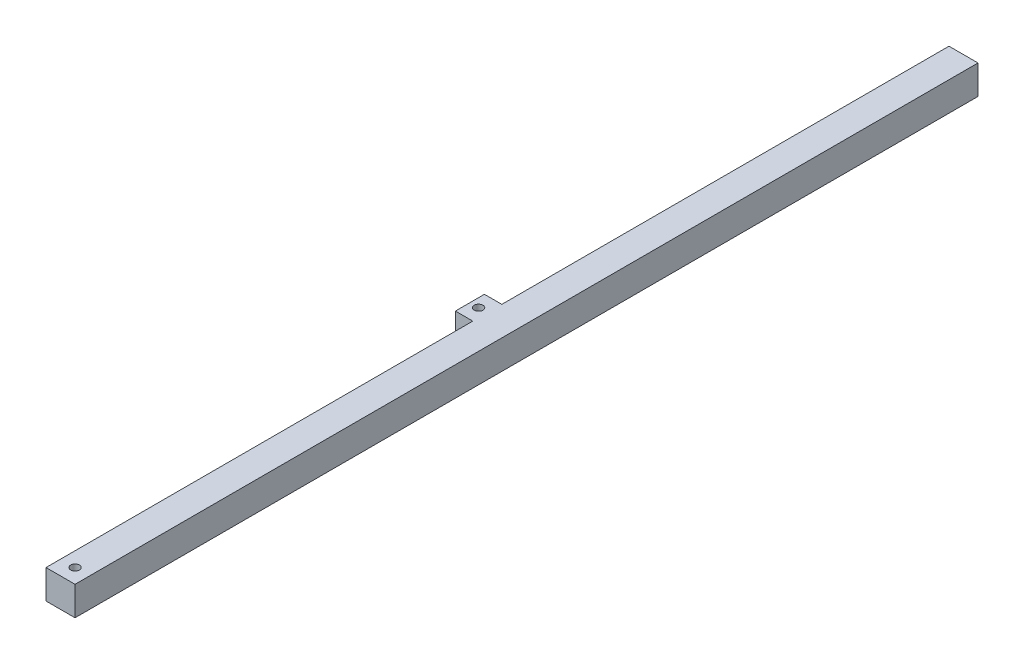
ISO-10303-21;
HEADER;
FILE_DESCRIPTION(('STEP AP214'),'2;1');
FILE_NAME('part.step','',(''),(''),'','','');
FILE_SCHEMA(('AUTOMOTIVE_DESIGN { 1 0 10303 214 1 1 1 1 }'));
ENDSEC;
DATA;
#1=APPLICATION_CONTEXT('core data for automotive mechanical design processes');
#2=APPLICATION_PROTOCOL_DEFINITION('international standard','automotive_design',2000,#1);
#3=PRODUCT_CONTEXT('',#1,'mechanical');
#4=PRODUCT('Part','Part','',(#3));
#5=PRODUCT_RELATED_PRODUCT_CATEGORY('part','',(#4));
#6=PRODUCT_DEFINITION_FORMATION('','',#4);
#7=PRODUCT_DEFINITION_CONTEXT('part definition',#1,'design');
#8=PRODUCT_DEFINITION('design','',#6,#7);
#9=PRODUCT_DEFINITION_SHAPE('','',#8);
#10=(LENGTH_UNIT() NAMED_UNIT(*) SI_UNIT(.MILLI.,.METRE.));
#11=(NAMED_UNIT(*) PLANE_ANGLE_UNIT() SI_UNIT($,.RADIAN.));
#12=(NAMED_UNIT(*) SI_UNIT($,.STERADIAN.) SOLID_ANGLE_UNIT());
#13=UNCERTAINTY_MEASURE_WITH_UNIT(LENGTH_MEASURE(1.E-05),#10,'distance_accuracy_value','');
#14=(GEOMETRIC_REPRESENTATION_CONTEXT(3) GLOBAL_UNCERTAINTY_ASSIGNED_CONTEXT((#13)) GLOBAL_UNIT_ASSIGNED_CONTEXT((#10,
#11,#12)) REPRESENTATION_CONTEXT('',''));
#15=CARTESIAN_POINT('',(0.,0.,0.));
#16=DIRECTION('',(0.,0.,1.));
#17=DIRECTION('',(1.,0.,0.));
#18=AXIS2_PLACEMENT_3D('',#15,#16,#17);
#19=CARTESIAN_POINT('',(0.,0.,150.5));
#20=DIRECTION('',(1.,0.,0.));
#21=DIRECTION('',(0.,0.,-1.));
#22=AXIS2_PLACEMENT_3D('',#19,#20,#21);
#23=PLANE('',#22);
#24=DIRECTION('',(0.,1.,0.));
#25=VECTOR('',#24,1.);
#26=CARTESIAN_POINT('',(0.,5.,82.));
#27=LINE('',#26,#25);
#28=CARTESIAN_POINT('',(0.,0.,82.));
#29=VERTEX_POINT('',#28);
#30=CARTESIAN_POINT('',(0.,5.,82.));
#31=VERTEX_POINT('',#30);
#32=EDGE_CURVE('E141',#29,#31,#27,.T.);
#33=ORIENTED_EDGE('',*,*,#32,.F.);
#34=DIRECTION('',(0.,0.,-1.));
#35=VECTOR('',#34,1.);
#36=CARTESIAN_POINT('',(0.,0.,150.5));
#37=LINE('',#36,#35);
#38=CARTESIAN_POINT('',(0.,0.,155.5));
#39=VERTEX_POINT('',#38);
#40=EDGE_CURVE('E128',#39,#29,#37,.T.);
#41=ORIENTED_EDGE('',*,*,#40,.F.);
#42=DIRECTION('',(0.,-1.,0.));
#43=VECTOR('',#42,1.);
#44=CARTESIAN_POINT('',(0.,5.00000000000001,155.5));
#45=LINE('',#44,#43);
#46=CARTESIAN_POINT('',(0.,5.00000000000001,155.5));
#47=VERTEX_POINT('',#46);
#48=EDGE_CURVE('E185',#47,#39,#45,.T.);
#49=ORIENTED_EDGE('',*,*,#48,.F.);
#50=DIRECTION('',(0.,0.,-1.));
#51=VECTOR('',#50,1.);
#52=CARTESIAN_POINT('',(0.,5.00000000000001,150.5));
#53=LINE('',#52,#51);
#54=EDGE_CURVE('E56',#47,#31,#53,.T.);
#55=ORIENTED_EDGE('',*,*,#54,.T.);
#56=EDGE_LOOP('',(#33,#41,#49,#55));
#57=FACE_BOUND('',#56,.T.);
#58=ADVANCED_FACE('F31',(#57),#23,.F.);
#59=DIRECTION('',(0.,-1.,0.));
#60=VECTOR('',#59,1.);
#61=CARTESIAN_POINT('',(0.,5.,77.));
#62=LINE('',#61,#60);
#63=CARTESIAN_POINT('',(0.,5.,77.));
#64=VERTEX_POINT('',#63);
#65=CARTESIAN_POINT('',(0.,0.,77.));
#66=VERTEX_POINT('',#65);
#67=EDGE_CURVE('E48',#64,#66,#62,.T.);
#68=ORIENTED_EDGE('',*,*,#67,.F.);
#69=CARTESIAN_POINT('',(0.,5.,0.));
#70=VERTEX_POINT('',#69);
#71=EDGE_CURVE('E230',#64,#70,#53,.T.);
#72=ORIENTED_EDGE('',*,*,#71,.T.);
#73=DIRECTION('',(0.,-1.,0.));
#74=VECTOR('',#73,1.);
#75=CARTESIAN_POINT('',(0.,0.,0.));
#76=LINE('',#75,#74);
#77=CARTESIAN_POINT('',(0.,0.,0.));
#78=VERTEX_POINT('',#77);
#79=EDGE_CURVE('E123',#70,#78,#76,.T.);
#80=ORIENTED_EDGE('',*,*,#79,.T.);
#81=EDGE_CURVE('E120',#66,#78,#37,.T.);
#82=ORIENTED_EDGE('',*,*,#81,.F.);
#83=EDGE_LOOP('',(#68,#72,#80,#82));
#84=FACE_BOUND('',#83,.T.);
#85=ADVANCED_FACE('F121',(#84),#23,.F.);
#86=CARTESIAN_POINT('',(0.999999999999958,0.,150.5));
#87=DIRECTION('',(-1.,0.,0.));
#88=DIRECTION('',(0.,0.,1.));
#89=AXIS2_PLACEMENT_3D('',#86,#87,#88);
#90=PLANE('',#89);
#91=DIRECTION('',(0.,1.,0.));
#92=VECTOR('',#91,1.);
#93=CARTESIAN_POINT('',(1.,0.,0.));
#94=LINE('',#93,#92);
#95=CARTESIAN_POINT('',(1.,0.,0.));
#96=VERTEX_POINT('',#95);
#97=CARTESIAN_POINT('',(1.,4.,0.));
#98=VERTEX_POINT('',#97);
#99=EDGE_CURVE('E195',#96,#98,#94,.T.);
#100=ORIENTED_EDGE('',*,*,#99,.T.);
#101=DIRECTION('',(0.,0.,-1.));
#102=VECTOR('',#101,1.);
#103=CARTESIAN_POINT('',(0.999999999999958,4.00000000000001,150.5));
#104=LINE('',#103,#102);
#105=CARTESIAN_POINT('',(0.999999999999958,4.00000000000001,150.5));
#106=VERTEX_POINT('',#105);
#107=EDGE_CURVE('E40',#106,#98,#104,.T.);
#108=ORIENTED_EDGE('',*,*,#107,.F.);
#109=DIRECTION('',(0.,1.,0.));
#110=VECTOR('',#109,1.);
#111=CARTESIAN_POINT('',(0.999999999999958,0.,150.5));
#112=LINE('',#111,#110);
#113=CARTESIAN_POINT('',(0.999999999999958,0.,150.5));
#114=VERTEX_POINT('',#113);
#115=EDGE_CURVE('E209',#114,#106,#112,.T.);
#116=ORIENTED_EDGE('',*,*,#115,.F.);
#117=DIRECTION('',(0.,0.,-1.));
#118=VECTOR('',#117,1.);
#119=CARTESIAN_POINT('',(0.999999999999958,0.,150.5));
#120=LINE('',#119,#118);
#121=EDGE_CURVE('E11',#114,#96,#120,.T.);
#122=ORIENTED_EDGE('',*,*,#121,.T.);
#123=EDGE_LOOP('',(#100,#108,#116,#122));
#124=FACE_BOUND('',#123,.T.);
#125=ADVANCED_FACE('F33',(#124),#90,.F.);
#126=CARTESIAN_POINT('',(0.999999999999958,4.00000000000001,150.5));
#127=DIRECTION('',(0.,1.,0.));
#128=DIRECTION('',(0.,0.,1.));
#129=AXIS2_PLACEMENT_3D('',#126,#127,#128);
#130=PLANE('',#129);
#131=DIRECTION('',(1.,0.,0.));
#132=VECTOR('',#131,1.);
#133=CARTESIAN_POINT('',(1.,4.,0.));
#134=LINE('',#133,#132);
#135=CARTESIAN_POINT('',(4.,4.,0.));
#136=VERTEX_POINT('',#135);
#137=EDGE_CURVE('E197',#98,#136,#134,.T.);
#138=ORIENTED_EDGE('',*,*,#137,.T.);
#139=DIRECTION('',(0.,0.,-1.));
#140=VECTOR('',#139,1.);
#141=CARTESIAN_POINT('',(3.99999999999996,4.00000000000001,150.5));
#142=LINE('',#141,#140);
#143=CARTESIAN_POINT('',(3.99999999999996,4.00000000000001,150.5));
#144=VERTEX_POINT('',#143);
#145=EDGE_CURVE('E242',#144,#136,#142,.T.);
#146=ORIENTED_EDGE('',*,*,#145,.F.);
#147=DIRECTION('',(1.,0.,0.));
#148=VECTOR('',#147,1.);
#149=CARTESIAN_POINT('',(0.999999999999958,4.00000000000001,150.5));
#150=LINE('',#149,#148);
#151=EDGE_CURVE('E210',#106,#144,#150,.T.);
#152=ORIENTED_EDGE('',*,*,#151,.F.);
#153=ORIENTED_EDGE('',*,*,#107,.T.);
#154=EDGE_LOOP('',(#138,#146,#152,#153));
#155=FACE_BOUND('',#154,.T.);
#156=ADVANCED_FACE('F307',(#155),#130,.F.);
#157=CARTESIAN_POINT('',(3.99999999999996,4.00000000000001,150.5));
#158=DIRECTION('',(1.,0.,0.));
#159=DIRECTION('',(0.,0.,-1.));
#160=AXIS2_PLACEMENT_3D('',#157,#158,#159);
#161=PLANE('',#160);
#162=DIRECTION('',(0.,-1.,0.));
#163=VECTOR('',#162,1.);
#164=CARTESIAN_POINT('',(4.,4.,0.));
#165=LINE('',#164,#163);
#166=CARTESIAN_POINT('',(4.,0.,0.));
#167=VERTEX_POINT('',#166);
#168=EDGE_CURVE('E199',#136,#167,#165,.T.);
#169=ORIENTED_EDGE('',*,*,#168,.T.);
#170=DIRECTION('',(0.,0.,-1.));
#171=VECTOR('',#170,1.);
#172=CARTESIAN_POINT('',(3.99999999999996,0.,150.5));
#173=LINE('',#172,#171);
#174=CARTESIAN_POINT('',(3.99999999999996,0.,150.5));
#175=VERTEX_POINT('',#174);
#176=EDGE_CURVE('E241',#175,#167,#173,.T.);
#177=ORIENTED_EDGE('',*,*,#176,.F.);
#178=DIRECTION('',(0.,-1.,0.));
#179=VECTOR('',#178,1.);
#180=CARTESIAN_POINT('',(3.99999999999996,4.00000000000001,150.5));
#181=LINE('',#180,#179);
#182=EDGE_CURVE('E129',#144,#175,#181,.T.);
#183=ORIENTED_EDGE('',*,*,#182,.F.);
#184=ORIENTED_EDGE('',*,*,#145,.T.);
#185=EDGE_LOOP('',(#169,#177,#183,#184));
#186=FACE_BOUND('',#185,.T.);
#187=ADVANCED_FACE('F304',(#186),#161,.F.);
#188=CARTESIAN_POINT('',(3.99999999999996,0.,150.5));
#189=DIRECTION('',(0.,1.,0.));
#190=DIRECTION('',(-1.,0.,0.));
#191=AXIS2_PLACEMENT_3D('',#188,#189,#190);
#192=PLANE('',#191);
#193=CARTESIAN_POINT('',(-1.50000000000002,0.,79.5));
#194=DIRECTION('',(0.,-1.,0.));
#195=DIRECTION('',(1.,0.,0.));
#196=AXIS2_PLACEMENT_3D('',#193,#194,#195);
#197=CIRCLE('',#196,0.75);
#198=CARTESIAN_POINT('',(-0.750000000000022,0.,79.5));
#199=VERTEX_POINT('',#198);
#200=EDGE_CURVE('E167',#199,#199,#197,.T.);
#201=ORIENTED_EDGE('',*,*,#200,.F.);
#202=EDGE_LOOP('',(#201));
#203=FACE_BOUND('',#202,.T.);
#204=CARTESIAN_POINT('',(2.49999999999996,0.,153.));
#205=DIRECTION('',(0.,-1.,0.));
#206=DIRECTION('',(1.,0.,0.));
#207=AXIS2_PLACEMENT_3D('',#204,#205,#206);
#208=CIRCLE('',#207,0.75);
#209=CARTESIAN_POINT('',(3.24999999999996,0.,153.));
#210=VERTEX_POINT('',#209);
#211=EDGE_CURVE('E160',#210,#210,#208,.T.);
#212=ORIENTED_EDGE('',*,*,#211,.F.);
#213=EDGE_LOOP('',(#212));
#214=FACE_BOUND('',#213,.T.);
#215=DIRECTION('',(1.,0.,0.));
#216=VECTOR('',#215,1.);
#217=CARTESIAN_POINT('',(4.,0.,0.));
#218=LINE('',#217,#216);
#219=CARTESIAN_POINT('',(5.,0.,0.));
#220=VERTEX_POINT('',#219);
#221=EDGE_CURVE('E201',#167,#220,#218,.T.);
#222=ORIENTED_EDGE('',*,*,#221,.T.);
#223=DIRECTION('',(0.,0.,-1.));
#224=VECTOR('',#223,1.);
#225=CARTESIAN_POINT('',(4.99999999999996,0.,150.5));
#226=LINE('',#225,#224);
#227=CARTESIAN_POINT('',(4.99999999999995,0.,155.5));
#228=VERTEX_POINT('',#227);
#229=EDGE_CURVE('E238',#228,#220,#226,.T.);
#230=ORIENTED_EDGE('',*,*,#229,.F.);
#231=DIRECTION('',(1.,0.,0.));
#232=VECTOR('',#231,1.);
#233=CARTESIAN_POINT('',(0.,0.,155.5));
#234=LINE('',#233,#232);
#235=EDGE_CURVE('E269',#39,#228,#234,.T.);
#236=ORIENTED_EDGE('',*,*,#235,.F.);
#237=ORIENTED_EDGE('',*,*,#40,.T.);
#238=DIRECTION('',(1.,0.,0.));
#239=VECTOR('',#238,1.);
#240=CARTESIAN_POINT('',(-3.00000000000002,0.,82.));
#241=LINE('',#240,#239);
#242=CARTESIAN_POINT('',(-3.00000000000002,0.,82.));
#243=VERTEX_POINT('',#242);
#244=EDGE_CURVE('E146',#243,#29,#241,.T.);
#245=ORIENTED_EDGE('',*,*,#244,.F.);
#246=DIRECTION('',(0.,0.,1.));
#247=VECTOR('',#246,1.);
#248=CARTESIAN_POINT('',(-3.00000000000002,0.,82.));
#249=LINE('',#248,#247);
#250=CARTESIAN_POINT('',(-3.00000000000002,0.,77.));
#251=VERTEX_POINT('',#250);
#252=EDGE_CURVE('E145',#251,#243,#249,.T.);
#253=ORIENTED_EDGE('',*,*,#252,.F.);
#254=DIRECTION('',(1.,0.,0.));
#255=VECTOR('',#254,1.);
#256=CARTESIAN_POINT('',(-3.00000000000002,0.,77.));
#257=LINE('',#256,#255);
#258=EDGE_CURVE('E136',#251,#66,#257,.T.);
#259=ORIENTED_EDGE('',*,*,#258,.T.);
#260=ORIENTED_EDGE('',*,*,#81,.T.);
#261=DIRECTION('',(1.,0.,0.));
#262=VECTOR('',#261,1.);
#263=CARTESIAN_POINT('',(0.,0.,0.));
#264=LINE('',#263,#262);
#265=EDGE_CURVE('E193',#78,#96,#264,.T.);
#266=ORIENTED_EDGE('',*,*,#265,.T.);
#267=ORIENTED_EDGE('',*,*,#121,.F.);
#268=DIRECTION('',(1.,0.,0.));
#269=VECTOR('',#268,1.);
#270=CARTESIAN_POINT('',(0.,0.,150.5));
#271=LINE('',#270,#269);
#272=EDGE_CURVE('E182',#114,#175,#271,.T.);
#273=ORIENTED_EDGE('',*,*,#272,.T.);
#274=ORIENTED_EDGE('',*,*,#176,.T.);
#275=EDGE_LOOP('',(#222,#230,#236,#237,#245,#253,#259,#260,#266,#267,#273,#274));
#276=FACE_BOUND('',#275,.T.);
#277=ADVANCED_FACE('F143',(#203,#214,#276),#192,.F.);
#278=CARTESIAN_POINT('',(4.99999999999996,5.00000000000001,150.5));
#279=DIRECTION('',(-1.,0.,0.));
#280=DIRECTION('',(0.,0.,1.));
#281=AXIS2_PLACEMENT_3D('',#278,#279,#280);
#282=PLANE('',#281);
#283=DIRECTION('',(0.,1.,0.));
#284=VECTOR('',#283,1.);
#285=CARTESIAN_POINT('',(5.,5.,0.));
#286=LINE('',#285,#284);
#287=CARTESIAN_POINT('',(5.,5.,0.));
#288=VERTEX_POINT('',#287);
#289=EDGE_CURVE('E203',#220,#288,#286,.T.);
#290=ORIENTED_EDGE('',*,*,#289,.T.);
#291=DIRECTION('',(0.,0.,-1.));
#292=VECTOR('',#291,1.);
#293=CARTESIAN_POINT('',(4.99999999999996,5.00000000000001,150.5));
#294=LINE('',#293,#292);
#295=CARTESIAN_POINT('',(4.99999999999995,5.00000000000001,155.5));
#296=VERTEX_POINT('',#295);
#297=EDGE_CURVE('E232',#296,#288,#294,.T.);
#298=ORIENTED_EDGE('',*,*,#297,.F.);
#299=DIRECTION('',(0.,1.,0.));
#300=VECTOR('',#299,1.);
#301=CARTESIAN_POINT('',(4.99999999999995,5.00000000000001,155.5));
#302=LINE('',#301,#300);
#303=EDGE_CURVE('E268',#228,#296,#302,.T.);
#304=ORIENTED_EDGE('',*,*,#303,.F.);
#305=ORIENTED_EDGE('',*,*,#229,.T.);
#306=EDGE_LOOP('',(#290,#298,#304,#305));
#307=FACE_BOUND('',#306,.T.);
#308=ADVANCED_FACE('F259',(#307),#282,.F.);
#309=CARTESIAN_POINT('',(0.,5.00000000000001,150.5));
#310=DIRECTION('',(0.,-1.,0.));
#311=DIRECTION('',(0.,0.,-1.));
#312=AXIS2_PLACEMENT_3D('',#309,#310,#311);
#313=PLANE('',#312);
#314=CARTESIAN_POINT('',(-1.50000000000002,5.,79.5));
#315=DIRECTION('',(0.,-1.,0.));
#316=DIRECTION('',(0.,0.,-1.));
#317=AXIS2_PLACEMENT_3D('',#314,#315,#316);
#318=CIRCLE('',#317,0.75);
#319=CARTESIAN_POINT('',(-1.50000000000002,5.,78.75));
#320=VERTEX_POINT('',#319);
#321=EDGE_CURVE('E35',#320,#320,#318,.T.);
#322=ORIENTED_EDGE('',*,*,#321,.T.);
#323=EDGE_LOOP('',(#322));
#324=FACE_BOUND('',#323,.T.);
#325=CARTESIAN_POINT('',(2.49999999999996,5.00000000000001,153.));
#326=DIRECTION('',(0.,-1.,0.));
#327=DIRECTION('',(1.,0.,0.));
#328=AXIS2_PLACEMENT_3D('',#325,#326,#327);
#329=CIRCLE('',#328,0.75);
#330=CARTESIAN_POINT('',(3.24999999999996,5.00000000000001,153.));
#331=VERTEX_POINT('',#330);
#332=EDGE_CURVE('E179',#331,#331,#329,.T.);
#333=ORIENTED_EDGE('',*,*,#332,.T.);
#334=EDGE_LOOP('',(#333));
#335=FACE_BOUND('',#334,.T.);
#336=DIRECTION('',(-1.,0.,0.));
#337=VECTOR('',#336,1.);
#338=CARTESIAN_POINT('',(0.,5.,0.));
#339=LINE('',#338,#337);
#340=EDGE_CURVE('E205',#288,#70,#339,.T.);
#341=ORIENTED_EDGE('',*,*,#340,.T.);
#342=ORIENTED_EDGE('',*,*,#71,.F.);
#343=DIRECTION('',(1.,0.,0.));
#344=VECTOR('',#343,1.);
#345=CARTESIAN_POINT('',(-3.00000000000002,5.,77.));
#346=LINE('',#345,#344);
#347=CARTESIAN_POINT('',(-3.00000000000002,5.,77.));
#348=VERTEX_POINT('',#347);
#349=EDGE_CURVE('E139',#348,#64,#346,.T.);
#350=ORIENTED_EDGE('',*,*,#349,.F.);
#351=DIRECTION('',(0.,0.,-1.));
#352=VECTOR('',#351,1.);
#353=CARTESIAN_POINT('',(-3.00000000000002,5.,82.));
#354=LINE('',#353,#352);
#355=CARTESIAN_POINT('',(-3.00000000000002,5.,82.));
#356=VERTEX_POINT('',#355);
#357=EDGE_CURVE('E172',#356,#348,#354,.T.);
#358=ORIENTED_EDGE('',*,*,#357,.F.);
#359=DIRECTION('',(1.,0.,0.));
#360=VECTOR('',#359,1.);
#361=CARTESIAN_POINT('',(-3.00000000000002,5.,82.));
#362=LINE('',#361,#360);
#363=EDGE_CURVE('E148',#356,#31,#362,.T.);
#364=ORIENTED_EDGE('',*,*,#363,.T.);
#365=ORIENTED_EDGE('',*,*,#54,.F.);
#366=DIRECTION('',(-1.,0.,0.));
#367=VECTOR('',#366,1.);
#368=CARTESIAN_POINT('',(0.,5.00000000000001,155.5));
#369=LINE('',#368,#367);
#370=EDGE_CURVE('E191',#296,#47,#369,.T.);
#371=ORIENTED_EDGE('',*,*,#370,.F.);
#372=ORIENTED_EDGE('',*,*,#297,.T.);
#373=EDGE_LOOP('',(#341,#342,#350,#358,#364,#365,#371,#372));
#374=FACE_BOUND('',#373,.T.);
#375=ADVANCED_FACE('F264',(#324,#335,#374),#313,.F.);
#376=CARTESIAN_POINT('',(1.,0.,0.));
#377=DIRECTION('',(0.,0.,1.));
#378=DIRECTION('',(1.,0.,0.));
#379=AXIS2_PLACEMENT_3D('',#376,#377,#378);
#380=PLANE('',#379);
#381=ORIENTED_EDGE('',*,*,#265,.F.);
#382=ORIENTED_EDGE('',*,*,#79,.F.);
#383=ORIENTED_EDGE('',*,*,#340,.F.);
#384=ORIENTED_EDGE('',*,*,#289,.F.);
#385=ORIENTED_EDGE('',*,*,#221,.F.);
#386=ORIENTED_EDGE('',*,*,#168,.F.);
#387=ORIENTED_EDGE('',*,*,#137,.F.);
#388=ORIENTED_EDGE('',*,*,#99,.F.);
#389=EDGE_LOOP('',(#381,#382,#383,#384,#385,#386,#387,#388));
#390=FACE_BOUND('',#389,.T.);
#391=ADVANCED_FACE('F255',(#390),#380,.F.);
#392=CARTESIAN_POINT('',(0.,0.,150.5));
#393=DIRECTION('',(0.,0.,1.));
#394=DIRECTION('',(1.,0.,0.));
#395=AXIS2_PLACEMENT_3D('',#392,#393,#394);
#396=PLANE('',#395);
#397=ORIENTED_EDGE('',*,*,#272,.F.);
#398=ORIENTED_EDGE('',*,*,#115,.T.);
#399=ORIENTED_EDGE('',*,*,#151,.T.);
#400=ORIENTED_EDGE('',*,*,#182,.T.);
#401=EDGE_LOOP('',(#397,#398,#399,#400));
#402=FACE_BOUND('',#401,.T.);
#403=ADVANCED_FACE('F316',(#402),#396,.F.);
#404=CARTESIAN_POINT('',(0.,0.,155.5));
#405=DIRECTION('',(0.,0.,1.));
#406=DIRECTION('',(1.,0.,0.));
#407=AXIS2_PLACEMENT_3D('',#404,#405,#406);
#408=PLANE('',#407);
#409=ORIENTED_EDGE('',*,*,#48,.T.);
#410=ORIENTED_EDGE('',*,*,#235,.T.);
#411=ORIENTED_EDGE('',*,*,#303,.T.);
#412=ORIENTED_EDGE('',*,*,#370,.T.);
#413=EDGE_LOOP('',(#409,#410,#411,#412));
#414=FACE_BOUND('',#413,.T.);
#415=ADVANCED_FACE('F272',(#414),#408,.T.);
#416=CARTESIAN_POINT('',(2.49999999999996,5.00000000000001,153.));
#417=DIRECTION('',(0.,-1.,0.));
#418=DIRECTION('',(1.,0.,0.));
#419=AXIS2_PLACEMENT_3D('',#416,#417,#418);
#420=CYLINDRICAL_SURFACE('',#419,0.75);
#421=ORIENTED_EDGE('',*,*,#332,.F.);
#422=EDGE_LOOP('',(#421));
#423=FACE_BOUND('',#422,.T.);
#424=ORIENTED_EDGE('',*,*,#211,.T.);
#425=EDGE_LOOP('',(#424));
#426=FACE_BOUND('',#425,.T.);
#427=ADVANCED_FACE('F323',(#423,#426),#420,.F.);
#428=CARTESIAN_POINT('',(-3.00000000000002,5.,82.));
#429=DIRECTION('',(0.,0.,-1.));
#430=DIRECTION('',(-1.,0.,0.));
#431=AXIS2_PLACEMENT_3D('',#428,#429,#430);
#432=PLANE('',#431);
#433=ORIENTED_EDGE('',*,*,#32,.T.);
#434=ORIENTED_EDGE('',*,*,#363,.F.);
#435=DIRECTION('',(0.,1.,0.));
#436=VECTOR('',#435,1.);
#437=CARTESIAN_POINT('',(-3.00000000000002,5.,82.));
#438=LINE('',#437,#436);
#439=EDGE_CURVE('E140',#243,#356,#438,.T.);
#440=ORIENTED_EDGE('',*,*,#439,.F.);
#441=ORIENTED_EDGE('',*,*,#244,.T.);
#442=EDGE_LOOP('',(#433,#434,#440,#441));
#443=FACE_BOUND('',#442,.T.);
#444=ADVANCED_FACE('F275',(#443),#432,.F.);
#445=CARTESIAN_POINT('',(-3.00000000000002,5.,77.));
#446=DIRECTION('',(0.,0.,1.));
#447=DIRECTION('',(1.,0.,0.));
#448=AXIS2_PLACEMENT_3D('',#445,#446,#447);
#449=PLANE('',#448);
#450=ORIENTED_EDGE('',*,*,#67,.T.);
#451=ORIENTED_EDGE('',*,*,#258,.F.);
#452=DIRECTION('',(0.,-1.,0.));
#453=VECTOR('',#452,1.);
#454=CARTESIAN_POINT('',(-3.00000000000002,5.,77.));
#455=LINE('',#454,#453);
#456=EDGE_CURVE('E174',#348,#251,#455,.T.);
#457=ORIENTED_EDGE('',*,*,#456,.F.);
#458=ORIENTED_EDGE('',*,*,#349,.T.);
#459=EDGE_LOOP('',(#450,#451,#457,#458));
#460=FACE_BOUND('',#459,.T.);
#461=ADVANCED_FACE('F134',(#460),#449,.F.);
#462=CARTESIAN_POINT('',(-3.00000000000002,5.,82.));
#463=DIRECTION('',(1.,0.,0.));
#464=DIRECTION('',(0.,0.,-1.));
#465=AXIS2_PLACEMENT_3D('',#462,#463,#464);
#466=PLANE('',#465);
#467=ORIENTED_EDGE('',*,*,#439,.T.);
#468=ORIENTED_EDGE('',*,*,#357,.T.);
#469=ORIENTED_EDGE('',*,*,#456,.T.);
#470=ORIENTED_EDGE('',*,*,#252,.T.);
#471=EDGE_LOOP('',(#467,#468,#469,#470));
#472=FACE_BOUND('',#471,.T.);
#473=ADVANCED_FACE('F278',(#472),#466,.F.);
#474=CARTESIAN_POINT('',(-1.50000000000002,5.00005,79.5));
#475=DIRECTION('',(0.,-1.,0.));
#476=DIRECTION('',(1.,0.,0.));
#477=AXIS2_PLACEMENT_3D('',#474,#475,#476);
#478=CYLINDRICAL_SURFACE('',#477,0.75);
#479=ORIENTED_EDGE('',*,*,#200,.T.);
#480=EDGE_LOOP('',(#479));
#481=FACE_BOUND('',#480,.T.);
#482=ORIENTED_EDGE('',*,*,#321,.F.);
#483=EDGE_LOOP('',(#482));
#484=FACE_BOUND('',#483,.T.);
#485=ADVANCED_FACE('F280',(#481,#484),#478,.F.);
#486=CLOSED_SHELL('',(#58,#85,#125,#156,#187,#277,#308,#375,#391,#403,#415,#427,#444,#461,#473,#485));
#487=MANIFOLD_SOLID_BREP('B2',#486);
#488=ADVANCED_BREP_SHAPE_REPRESENTATION('',(#18,#487),#14);
#489=SHAPE_DEFINITION_REPRESENTATION(#9,#488);
ENDSEC;
END-ISO-10303-21;
